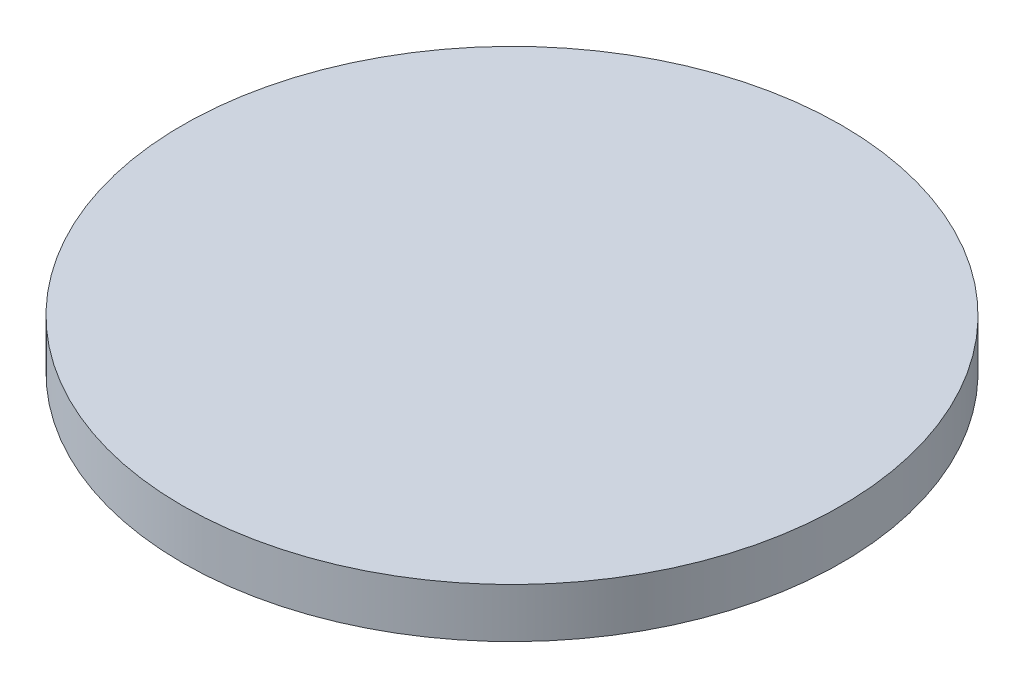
from build123d import *

# Parameters (mm, degrees)
SKETCH1_R           = 29.38
BOSS_EXTRUDE1_DEPTH = 4.41


with BuildPart() as part:
    # Sketch1 → Boss-Extrude1 (new body)
    with BuildSketch(Plane(origin=(0, 0, 0), x_dir=(1, 0, 0), z_dir=(0, 1, 0))):
        with Locations(Location((0, 0, 0), (0, 0, 270))):
            Circle(SKETCH1_R)
    extrude(amount=BOSS_EXTRUDE1_DEPTH)


solid = part.part
